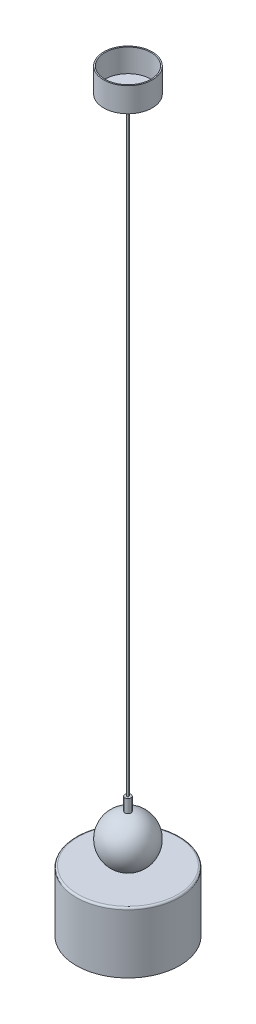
ISO-10303-21;
HEADER;
FILE_DESCRIPTION(('STEP AP214'),'2;1');
FILE_NAME('part.step','',(''),(''),'','','');
FILE_SCHEMA(('AUTOMOTIVE_DESIGN { 1 0 10303 214 1 1 1 1 }'));
ENDSEC;
DATA;
#1=APPLICATION_CONTEXT('core data for automotive mechanical design processes');
#2=APPLICATION_PROTOCOL_DEFINITION('international standard','automotive_design',2000,#1);
#3=PRODUCT_CONTEXT('',#1,'mechanical');
#4=PRODUCT('Part','Part','',(#3));
#5=PRODUCT_RELATED_PRODUCT_CATEGORY('part','',(#4));
#6=PRODUCT_DEFINITION_FORMATION('','',#4);
#7=PRODUCT_DEFINITION_CONTEXT('part definition',#1,'design');
#8=PRODUCT_DEFINITION('design','',#6,#7);
#9=PRODUCT_DEFINITION_SHAPE('','',#8);
#10=(LENGTH_UNIT() NAMED_UNIT(*) SI_UNIT(.MILLI.,.METRE.));
#11=(NAMED_UNIT(*) PLANE_ANGLE_UNIT() SI_UNIT($,.RADIAN.));
#12=(NAMED_UNIT(*) SI_UNIT($,.STERADIAN.) SOLID_ANGLE_UNIT());
#13=UNCERTAINTY_MEASURE_WITH_UNIT(LENGTH_MEASURE(1.E-05),#10,'distance_accuracy_value','');
#14=(GEOMETRIC_REPRESENTATION_CONTEXT(3) GLOBAL_UNCERTAINTY_ASSIGNED_CONTEXT((#13)) GLOBAL_UNIT_ASSIGNED_CONTEXT((#10,
#11,#12)) REPRESENTATION_CONTEXT('',''));
#15=CARTESIAN_POINT('',(0.,0.,0.));
#16=DIRECTION('',(0.,0.,1.));
#17=DIRECTION('',(1.,0.,0.));
#18=AXIS2_PLACEMENT_3D('',#15,#16,#17);
#19=CARTESIAN_POINT('',(0.,1239.,0.));
#20=DIRECTION('',(0.,-1.,0.));
#21=DIRECTION('',(0.,0.,-1.));
#22=AXIS2_PLACEMENT_3D('',#19,#20,#21);
#23=CYLINDRICAL_SURFACE('',#22,40.);
#24=CARTESIAN_POINT('',(0.,1239.,0.));
#25=DIRECTION('',(0.,1.,0.));
#26=DIRECTION('',(0.,0.,1.));
#27=AXIS2_PLACEMENT_3D('',#24,#25,#26);
#28=CIRCLE('',#27,40.);
#29=CARTESIAN_POINT('',(0.,1239.,40.));
#30=VERTEX_POINT('',#29);
#31=EDGE_CURVE('E11',#30,#30,#28,.T.);
#32=ORIENTED_EDGE('',*,*,#31,.F.);
#33=EDGE_LOOP('',(#32));
#34=FACE_BOUND('',#33,.T.);
#35=CARTESIAN_POINT('',(0.,1199.,0.));
#36=DIRECTION('',(0.,1.,0.));
#37=DIRECTION('',(0.,0.,1.));
#38=AXIS2_PLACEMENT_3D('',#35,#36,#37);
#39=CIRCLE('',#38,40.);
#40=CARTESIAN_POINT('',(0.,1199.,40.));
#41=VERTEX_POINT('',#40);
#42=EDGE_CURVE('E55',#41,#41,#39,.T.);
#43=ORIENTED_EDGE('',*,*,#42,.T.);
#44=EDGE_LOOP('',(#43));
#45=FACE_BOUND('',#44,.T.);
#46=ADVANCED_FACE('F52',(#34,#45),#23,.T.);
#47=CARTESIAN_POINT('',(0.,1239.,0.));
#48=DIRECTION('',(0.,1.,0.));
#49=DIRECTION('',(0.,0.,1.));
#50=AXIS2_PLACEMENT_3D('',#47,#48,#49);
#51=PLANE('',#50);
#52=CARTESIAN_POINT('',(0.,1239.,0.));
#53=DIRECTION('',(0.,1.,0.));
#54=DIRECTION('',(0.,0.,1.));
#55=AXIS2_PLACEMENT_3D('',#52,#53,#54);
#56=CIRCLE('',#55,38.);
#57=CARTESIAN_POINT('',(0.,1239.,38.));
#58=VERTEX_POINT('',#57);
#59=EDGE_CURVE('E65',#58,#58,#56,.T.);
#60=ORIENTED_EDGE('',*,*,#59,.F.);
#61=EDGE_LOOP('',(#60));
#62=FACE_BOUND('',#61,.T.);
#63=ORIENTED_EDGE('',*,*,#31,.T.);
#64=EDGE_LOOP('',(#63));
#65=FACE_BOUND('',#64,.T.);
#66=ADVANCED_FACE('F86',(#62,#65),#51,.T.);
#67=CARTESIAN_POINT('',(0.,1199.,0.));
#68=DIRECTION('',(0.,1.,0.));
#69=DIRECTION('',(0.,0.,1.));
#70=AXIS2_PLACEMENT_3D('',#67,#68,#69);
#71=PLANE('',#70);
#72=ORIENTED_EDGE('',*,*,#42,.F.);
#73=EDGE_LOOP('',(#72));
#74=FACE_BOUND('',#73,.T.);
#75=ADVANCED_FACE('F78',(#74),#71,.F.);
#76=CARTESIAN_POINT('',(0.,1239.,0.));
#77=DIRECTION('',(0.,-1.,0.));
#78=DIRECTION('',(0.,0.,-1.));
#79=AXIS2_PLACEMENT_3D('',#76,#77,#78);
#80=CYLINDRICAL_SURFACE('',#79,38.);
#81=ORIENTED_EDGE('',*,*,#59,.T.);
#82=EDGE_LOOP('',(#81));
#83=FACE_BOUND('',#82,.T.);
#84=CARTESIAN_POINT('',(0.,1201.,0.));
#85=DIRECTION('',(0.,1.,0.));
#86=DIRECTION('',(0.,0.,1.));
#87=AXIS2_PLACEMENT_3D('',#84,#85,#86);
#88=CIRCLE('',#87,38.);
#89=CARTESIAN_POINT('',(0.,1201.,38.));
#90=VERTEX_POINT('',#89);
#91=EDGE_CURVE('E70',#90,#90,#88,.T.);
#92=ORIENTED_EDGE('',*,*,#91,.F.);
#93=EDGE_LOOP('',(#92));
#94=FACE_BOUND('',#93,.T.);
#95=ADVANCED_FACE('F76',(#83,#94),#80,.F.);
#96=CARTESIAN_POINT('',(0.,1201.,0.));
#97=DIRECTION('',(0.,1.,0.));
#98=DIRECTION('',(0.,0.,1.));
#99=AXIS2_PLACEMENT_3D('',#96,#97,#98);
#100=PLANE('',#99);
#101=ORIENTED_EDGE('',*,*,#91,.T.);
#102=EDGE_LOOP('',(#101));
#103=FACE_BOUND('',#102,.T.);
#104=ADVANCED_FACE('F74',(#103),#100,.T.);
#105=CLOSED_SHELL('',(#46,#66,#75,#95,#104));
#106=MANIFOLD_SOLID_BREP('B2',#105);
#107=CARTESIAN_POINT('',(0.,1199.,0.));
#108=DIRECTION('',(0.,-1.,0.));
#109=DIRECTION('',(0.,0.,-1.));
#110=AXIS2_PLACEMENT_3D('',#107,#108,#109);
#111=CYLINDRICAL_SURFACE('',#110,1.5);
#112=CARTESIAN_POINT('',(0.,1199.,0.));
#113=DIRECTION('',(0.,1.,0.));
#114=DIRECTION('',(0.,0.,1.));
#115=AXIS2_PLACEMENT_3D('',#112,#113,#114);
#116=CIRCLE('',#115,1.5);
#117=CARTESIAN_POINT('',(0.,1199.,1.5));
#118=VERTEX_POINT('',#117);
#119=EDGE_CURVE('E51',#118,#118,#116,.T.);
#120=ORIENTED_EDGE('',*,*,#119,.F.);
#121=EDGE_LOOP('',(#120));
#122=FACE_BOUND('',#121,.T.);
#123=CARTESIAN_POINT('',(0.,199.,0.));
#124=DIRECTION('',(0.,1.,0.));
#125=DIRECTION('',(0.,0.,1.));
#126=AXIS2_PLACEMENT_3D('',#123,#124,#125);
#127=CIRCLE('',#126,1.5);
#128=CARTESIAN_POINT('',(0.,199.,1.5));
#129=VERTEX_POINT('',#128);
#130=EDGE_CURVE('E153',#129,#129,#127,.T.);
#131=ORIENTED_EDGE('',*,*,#130,.T.);
#132=EDGE_LOOP('',(#131));
#133=FACE_BOUND('',#132,.T.);
#134=ADVANCED_FACE('F150',(#122,#133),#111,.T.);
#135=CARTESIAN_POINT('',(0.,1199.,0.));
#136=DIRECTION('',(0.,1.,0.));
#137=DIRECTION('',(0.,0.,1.));
#138=AXIS2_PLACEMENT_3D('',#135,#136,#137);
#139=PLANE('',#138);
#140=ORIENTED_EDGE('',*,*,#119,.T.);
#141=EDGE_LOOP('',(#140));
#142=FACE_BOUND('',#141,.T.);
#143=ADVANCED_FACE('F167',(#142),#139,.T.);
#144=CARTESIAN_POINT('',(0.,199.,0.));
#145=DIRECTION('',(0.,1.,0.));
#146=DIRECTION('',(0.,0.,1.));
#147=AXIS2_PLACEMENT_3D('',#144,#145,#146);
#148=PLANE('',#147);
#149=ORIENTED_EDGE('',*,*,#130,.F.);
#150=EDGE_LOOP('',(#149));
#151=FACE_BOUND('',#150,.T.);
#152=ADVANCED_FACE('F165',(#151),#148,.F.);
#153=CLOSED_SHELL('',(#134,#143,#152));
#154=MANIFOLD_SOLID_BREP('B6',#153);
#155=CARTESIAN_POINT('',(0.,199.,0.));
#156=DIRECTION('',(0.,-1.,0.));
#157=DIRECTION('',(0.,0.,-1.));
#158=AXIS2_PLACEMENT_3D('',#155,#156,#157);
#159=CYLINDRICAL_SURFACE('',#158,5.);
#160=CARTESIAN_POINT('',(0.,199.,0.));
#161=DIRECTION('',(0.,1.,0.));
#162=DIRECTION('',(0.,0.,1.));
#163=AXIS2_PLACEMENT_3D('',#160,#161,#162);
#164=CIRCLE('',#163,5.);
#165=CARTESIAN_POINT('',(0.,199.,-5.));
#166=VERTEX_POINT('',#165);
#167=EDGE_CURVE('E149',#166,#166,#164,.T.);
#168=CARTESIAN_POINT('',(0.,170.,0.));
#169=DIRECTION('',(0.,1.,0.));
#170=DIRECTION('',(0.,0.,1.));
#171=AXIS2_PLACEMENT_3D('',#168,#169,#170);
#172=CIRCLE('',#171,5.);
#173=CARTESIAN_POINT('',(0.,170.,-5.));
#174=VERTEX_POINT('',#173);
#175=EDGE_CURVE('E213',#174,#174,#172,.T.);
#176=CARTESIAN_POINT('',(0.,199.,-5.));
#177=CARTESIAN_POINT('',(0.,198.697916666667,-5.));
#178=CARTESIAN_POINT('',(0.,198.395833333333,-5.));
#179=CARTESIAN_POINT('',(0.,197.791666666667,-5.));
#180=CARTESIAN_POINT('',(0.,197.489583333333,-5.));
#181=CARTESIAN_POINT('',(0.,196.885416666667,-5.));
#182=CARTESIAN_POINT('',(0.,196.583333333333,-5.));
#183=CARTESIAN_POINT('',(0.,195.979166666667,-5.));
#184=CARTESIAN_POINT('',(0.,195.677083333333,-5.));
#185=CARTESIAN_POINT('',(0.,195.072916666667,-5.));
#186=CARTESIAN_POINT('',(0.,194.770833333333,-5.));
#187=CARTESIAN_POINT('',(0.,194.166666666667,-5.));
#188=CARTESIAN_POINT('',(0.,193.864583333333,-5.));
#189=CARTESIAN_POINT('',(0.,193.260416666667,-5.));
#190=CARTESIAN_POINT('',(0.,192.958333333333,-5.));
#191=CARTESIAN_POINT('',(0.,192.354166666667,-5.));
#192=CARTESIAN_POINT('',(0.,192.052083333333,-5.));
#193=CARTESIAN_POINT('',(0.,191.447916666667,-5.));
#194=CARTESIAN_POINT('',(0.,191.145833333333,-5.));
#195=CARTESIAN_POINT('',(0.,190.541666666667,-5.));
#196=CARTESIAN_POINT('',(0.,190.239583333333,-5.));
#197=CARTESIAN_POINT('',(0.,189.635416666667,-5.));
#198=CARTESIAN_POINT('',(0.,189.333333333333,-5.));
#199=CARTESIAN_POINT('',(0.,188.729166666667,-5.));
#200=CARTESIAN_POINT('',(0.,188.427083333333,-5.));
#201=CARTESIAN_POINT('',(0.,187.822916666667,-5.));
#202=CARTESIAN_POINT('',(0.,187.520833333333,-5.));
#203=CARTESIAN_POINT('',(0.,186.916666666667,-5.));
#204=CARTESIAN_POINT('',(0.,186.614583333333,-5.));
#205=CARTESIAN_POINT('',(0.,186.010416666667,-5.));
#206=CARTESIAN_POINT('',(0.,185.708333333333,-5.));
#207=CARTESIAN_POINT('',(0.,185.104166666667,-5.));
#208=CARTESIAN_POINT('',(0.,184.802083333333,-5.));
#209=CARTESIAN_POINT('',(0.,184.197916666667,-5.));
#210=CARTESIAN_POINT('',(0.,183.895833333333,-5.));
#211=CARTESIAN_POINT('',(0.,183.291666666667,-5.));
#212=CARTESIAN_POINT('',(0.,182.989583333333,-5.));
#213=CARTESIAN_POINT('',(0.,182.385416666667,-5.));
#214=CARTESIAN_POINT('',(0.,182.083333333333,-5.));
#215=CARTESIAN_POINT('',(0.,181.479166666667,-5.));
#216=CARTESIAN_POINT('',(0.,181.177083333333,-5.));
#217=CARTESIAN_POINT('',(0.,180.572916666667,-5.));
#218=CARTESIAN_POINT('',(0.,180.270833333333,-5.));
#219=CARTESIAN_POINT('',(0.,179.666666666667,-5.));
#220=CARTESIAN_POINT('',(0.,179.364583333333,-5.));
#221=CARTESIAN_POINT('',(0.,178.760416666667,-5.));
#222=CARTESIAN_POINT('',(0.,178.458333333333,-5.));
#223=CARTESIAN_POINT('',(0.,177.854166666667,-5.));
#224=CARTESIAN_POINT('',(0.,177.552083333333,-5.));
#225=CARTESIAN_POINT('',(0.,176.947916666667,-5.));
#226=CARTESIAN_POINT('',(0.,176.645833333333,-5.));
#227=CARTESIAN_POINT('',(0.,176.041666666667,-5.));
#228=CARTESIAN_POINT('',(0.,175.739583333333,-5.));
#229=CARTESIAN_POINT('',(0.,175.135416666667,-5.));
#230=CARTESIAN_POINT('',(0.,174.833333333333,-5.));
#231=CARTESIAN_POINT('',(0.,174.229166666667,-5.));
#232=CARTESIAN_POINT('',(0.,173.927083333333,-5.));
#233=CARTESIAN_POINT('',(0.,173.322916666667,-5.));
#234=CARTESIAN_POINT('',(0.,173.020833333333,-5.));
#235=CARTESIAN_POINT('',(0.,172.416666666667,-5.));
#236=CARTESIAN_POINT('',(0.,172.114583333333,-5.));
#237=CARTESIAN_POINT('',(0.,171.510416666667,-5.));
#238=CARTESIAN_POINT('',(0.,171.208333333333,-5.));
#239=CARTESIAN_POINT('',(0.,170.604166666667,-5.));
#240=CARTESIAN_POINT('',(0.,170.302083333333,-5.));
#241=CARTESIAN_POINT('',(0.,170.,-5.));
#242=B_SPLINE_CURVE_WITH_KNOTS('',3,(#176,#177,#178,#179,#180,#181,#182,#183,#184,#185,#186,
#187,#188,#189,#190,#191,#192,#193,#194,#195,#196,#197,#198,#199,#200,#201,#202,#203,#204,#205,
#206,#207,#208,#209,#210,#211,#212,#213,#214,#215,#216,#217,#218,#219,#220,#221,#222,#223,#224,
#225,#226,#227,#228,#229,#230,#231,#232,#233,#234,#235,#236,#237,#238,#239,#240,#241),
.UNSPECIFIED.,.F.,.F.,(4,2,2,2,2,2,2,2,2,2,2,2,2,2,2,2,2,2,2,2,2,2,2,2,2,2,2,2,2,2,2,2,4),(0.,
0.906250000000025,1.81250000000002,2.71875000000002,3.62500000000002,4.53125000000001,
5.43750000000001,6.34375000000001,7.25000000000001,8.15625,9.0625,9.96875,10.875,11.78125,
12.6875,13.59375,14.5,15.40625,16.3125,17.21875,18.125,19.03125,19.9375,20.84375,21.75,22.65625,
23.5625,24.46875,25.375,26.28125,27.1875,28.09375,29.),.UNSPECIFIED.);
#243=EDGE_CURVE('BSEAM210',#166,#174,#242,.T.);
#244=ORIENTED_EDGE('',*,*,#167,.F.);
#245=ORIENTED_EDGE('',*,*,#175,.T.);
#246=ORIENTED_EDGE('',*,*,#243,.T.);
#247=ORIENTED_EDGE('',*,*,#243,.F.);
#248=EDGE_LOOP('',(#244,#246,#245,#247));
#249=FACE_BOUND('',#248,.T.);
#250=ADVANCED_FACE('F210',(#249),#159,.T.);
#251=CARTESIAN_POINT('',(0.,199.,0.));
#252=DIRECTION('',(0.,1.,0.));
#253=DIRECTION('',(0.,0.,1.));
#254=AXIS2_PLACEMENT_3D('',#251,#252,#253);
#255=PLANE('',#254);
#256=ORIENTED_EDGE('',*,*,#167,.T.);
#257=EDGE_LOOP('',(#256));
#258=FACE_BOUND('',#257,.T.);
#259=ADVANCED_FACE('F227',(#258),#255,.T.);
#260=CARTESIAN_POINT('',(0.,170.,0.));
#261=DIRECTION('',(0.,1.,0.));
#262=DIRECTION('',(0.,0.,1.));
#263=AXIS2_PLACEMENT_3D('',#260,#261,#262);
#264=PLANE('',#263);
#265=ORIENTED_EDGE('',*,*,#175,.F.);
#266=EDGE_LOOP('',(#265));
#267=FACE_BOUND('',#266,.T.);
#268=ADVANCED_FACE('F225',(#267),#264,.F.);
#269=CLOSED_SHELL('',(#250,#259,#268));
#270=MANIFOLD_SOLID_BREP('B46',#269);
#271=CARTESIAN_POINT('',(0.,47.,0.));
#272=DIRECTION('',(0.,1.,0.));
#273=DIRECTION('',(0.,0.,1.));
#274=AXIS2_PLACEMENT_3D('',#271,#272,#273);
#275=CYLINDRICAL_SURFACE('',#274,34.872718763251);
#276=CARTESIAN_POINT('',(0.,47.,0.));
#277=DIRECTION('',(0.,-1.,0.));
#278=DIRECTION('',(0.,0.,-1.));
#279=AXIS2_PLACEMENT_3D('',#276,#277,#278);
#280=CIRCLE('',#279,34.872718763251);
#281=CARTESIAN_POINT('',(0.,47.,-34.872718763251));
#282=VERTEX_POINT('',#281);
#283=EDGE_CURVE('E209',#282,#282,#280,.T.);
#284=ORIENTED_EDGE('',*,*,#283,.F.);
#285=EDGE_LOOP('',(#284));
#286=FACE_BOUND('',#285,.T.);
#287=CARTESIAN_POINT('',(0.,97.,0.));
#288=DIRECTION('',(0.,-1.,0.));
#289=DIRECTION('',(0.,0.,-1.));
#290=AXIS2_PLACEMENT_3D('',#287,#288,#289);
#291=CIRCLE('',#290,34.872718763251);
#292=CARTESIAN_POINT('',(0.,97.,-34.872718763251));
#293=VERTEX_POINT('',#292);
#294=EDGE_CURVE('E271',#293,#293,#291,.T.);
#295=ORIENTED_EDGE('',*,*,#294,.T.);
#296=EDGE_LOOP('',(#295));
#297=FACE_BOUND('',#296,.T.);
#298=ADVANCED_FACE('F268',(#286,#297),#275,.T.);
#299=CARTESIAN_POINT('',(0.,47.,0.));
#300=DIRECTION('',(0.,-1.,0.));
#301=DIRECTION('',(0.,0.,-1.));
#302=AXIS2_PLACEMENT_3D('',#299,#300,#301);
#303=PLANE('',#302);
#304=ORIENTED_EDGE('',*,*,#283,.T.);
#305=EDGE_LOOP('',(#304));
#306=FACE_BOUND('',#305,.T.);
#307=ADVANCED_FACE('F285',(#306),#303,.T.);
#308=CARTESIAN_POINT('',(0.,97.,0.));
#309=DIRECTION('',(0.,-1.,0.));
#310=DIRECTION('',(0.,0.,-1.));
#311=AXIS2_PLACEMENT_3D('',#308,#309,#310);
#312=PLANE('',#311);
#313=ORIENTED_EDGE('',*,*,#294,.F.);
#314=EDGE_LOOP('',(#313));
#315=FACE_BOUND('',#314,.T.);
#316=ADVANCED_FACE('F283',(#315),#312,.F.);
#317=CLOSED_SHELL('',(#298,#307,#316));
#318=MANIFOLD_SOLID_BREP('B144',#317);
#319=CARTESIAN_POINT('',(0.,137.960540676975,0.));
#320=DIRECTION('',(1.,0.,0.));
#321=DIRECTION('',(0.,-1.,0.));
#322=AXIS2_PLACEMENT_3D('',#319,#320,#321);
#323=SPHERICAL_SURFACE('',#322,40.);
#324=CARTESIAN_POINT('',(40.,137.960540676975,0.));
#325=VERTEX_POINT('',#324);
#326=VERTEX_LOOP('',#325);
#327=FACE_BOUND('',#326,.T.);
#328=ADVANCED_FACE('F327',(#327),#323,.T.);
#329=CLOSED_SHELL('',(#328));
#330=MANIFOLD_SOLID_BREP('B204',#329);
#331=CARTESIAN_POINT('',(0.,100.,0.));
#332=DIRECTION('',(0.,-1.,0.));
#333=DIRECTION('',(0.,0.,-1.));
#334=AXIS2_PLACEMENT_3D('',#331,#332,#333);
#335=CYLINDRICAL_SURFACE('',#334,85.);
#336=CARTESIAN_POINT('',(0.,97.,0.));
#337=DIRECTION('',(0.,1.,0.));
#338=DIRECTION('',(0.,0.,1.));
#339=AXIS2_PLACEMENT_3D('',#336,#337,#338);
#340=CIRCLE('',#339,85.);
#341=CARTESIAN_POINT('',(0.,97.,85.));
#342=VERTEX_POINT('',#341);
#343=EDGE_CURVE('E326',#342,#342,#340,.F.);
#344=ORIENTED_EDGE('',*,*,#343,.T.);
#345=EDGE_LOOP('',(#344));
#346=FACE_BOUND('',#345,.T.);
#347=CARTESIAN_POINT('',(0.,0.,0.));
#348=DIRECTION('',(0.,1.,0.));
#349=DIRECTION('',(0.,0.,1.));
#350=AXIS2_PLACEMENT_3D('',#347,#348,#349);
#351=CIRCLE('',#350,85.);
#352=CARTESIAN_POINT('',(0.,0.,85.));
#353=VERTEX_POINT('',#352);
#354=EDGE_CURVE('E361',#353,#353,#351,.T.);
#355=ORIENTED_EDGE('',*,*,#354,.T.);
#356=EDGE_LOOP('',(#355));
#357=FACE_BOUND('',#356,.T.);
#358=ADVANCED_FACE('F346',(#346,#357),#335,.T.);
#359=CARTESIAN_POINT('',(0.,100.,0.));
#360=DIRECTION('',(0.,1.,0.));
#361=DIRECTION('',(0.,0.,1.));
#362=AXIS2_PLACEMENT_3D('',#359,#360,#361);
#363=PLANE('',#362);
#364=CARTESIAN_POINT('',(0.,100.,0.));
#365=DIRECTION('',(0.,1.,0.));
#366=DIRECTION('',(0.,0.,1.));
#367=AXIS2_PLACEMENT_3D('',#364,#365,#366);
#368=CIRCLE('',#367,82.);
#369=CARTESIAN_POINT('',(0.,100.,82.));
#370=VERTEX_POINT('',#369);
#371=EDGE_CURVE('E354',#370,#370,#368,.T.);
#372=ORIENTED_EDGE('',*,*,#371,.T.);
#373=EDGE_LOOP('',(#372));
#374=FACE_BOUND('',#373,.T.);
#375=ADVANCED_FACE('F387',(#374),#363,.T.);
#376=CARTESIAN_POINT('',(0.,0.,0.));
#377=DIRECTION('',(0.,1.,0.));
#378=DIRECTION('',(0.,0.,1.));
#379=AXIS2_PLACEMENT_3D('',#376,#377,#378);
#380=PLANE('',#379);
#381=CARTESIAN_POINT('',(0.,0.,0.));
#382=DIRECTION('',(0.,1.,0.));
#383=DIRECTION('',(0.,0.,1.));
#384=AXIS2_PLACEMENT_3D('',#381,#382,#383);
#385=CIRCLE('',#384,82.);
#386=CARTESIAN_POINT('',(0.,0.,82.));
#387=VERTEX_POINT('',#386);
#388=EDGE_CURVE('E369',#387,#387,#385,.T.);
#389=ORIENTED_EDGE('',*,*,#388,.T.);
#390=EDGE_LOOP('',(#389));
#391=FACE_BOUND('',#390,.T.);
#392=ORIENTED_EDGE('',*,*,#354,.F.);
#393=EDGE_LOOP('',(#392));
#394=FACE_BOUND('',#393,.T.);
#395=ADVANCED_FACE('F391',(#391,#394),#380,.F.);
#396=CARTESIAN_POINT('',(0.,97.,0.));
#397=DIRECTION('',(0.,1.,0.));
#398=DIRECTION('',(0.,0.,1.));
#399=AXIS2_PLACEMENT_3D('',#396,#397,#398);
#400=TOROIDAL_SURFACE('',#399,82.,3.);
#401=ORIENTED_EDGE('',*,*,#343,.F.);
#402=EDGE_LOOP('',(#401));
#403=FACE_BOUND('',#402,.T.);
#404=ORIENTED_EDGE('',*,*,#371,.F.);
#405=EDGE_LOOP('',(#404));
#406=FACE_BOUND('',#405,.T.);
#407=ADVANCED_FACE('F348',(#403,#406),#400,.T.);
#408=CARTESIAN_POINT('',(0.,100.,0.));
#409=DIRECTION('',(0.,-1.,0.));
#410=DIRECTION('',(0.,0.,-1.));
#411=AXIS2_PLACEMENT_3D('',#408,#409,#410);
#412=CYLINDRICAL_SURFACE('',#411,82.);
#413=CARTESIAN_POINT('',(0.,97.,0.));
#414=DIRECTION('',(0.,1.,0.));
#415=DIRECTION('',(0.,0.,1.));
#416=AXIS2_PLACEMENT_3D('',#413,#414,#415);
#417=CIRCLE('',#416,82.);
#418=CARTESIAN_POINT('',(0.,97.,82.));
#419=VERTEX_POINT('',#418);
#420=EDGE_CURVE('E366',#419,#419,#417,.T.);
#421=ORIENTED_EDGE('',*,*,#420,.T.);
#422=EDGE_LOOP('',(#421));
#423=FACE_BOUND('',#422,.T.);
#424=ORIENTED_EDGE('',*,*,#388,.F.);
#425=EDGE_LOOP('',(#424));
#426=FACE_BOUND('',#425,.T.);
#427=ADVANCED_FACE('F375',(#423,#426),#412,.F.);
#428=CARTESIAN_POINT('',(0.,97.,0.));
#429=DIRECTION('',(0.,1.,0.));
#430=DIRECTION('',(0.,0.,1.));
#431=AXIS2_PLACEMENT_3D('',#428,#429,#430);
#432=PLANE('',#431);
#433=ORIENTED_EDGE('',*,*,#420,.F.);
#434=EDGE_LOOP('',(#433));
#435=FACE_BOUND('',#434,.T.);
#436=ADVANCED_FACE('F378',(#435),#432,.F.);
#437=CLOSED_SHELL('',(#358,#375,#395,#407,#427,#436));
#438=MANIFOLD_SOLID_BREP('B264',#437);
#439=ADVANCED_BREP_SHAPE_REPRESENTATION('',(#18,#106,#154,#270,#318,#330,#438),#14);
#440=SHAPE_DEFINITION_REPRESENTATION(#9,#439);
ENDSEC;
END-ISO-10303-21;
